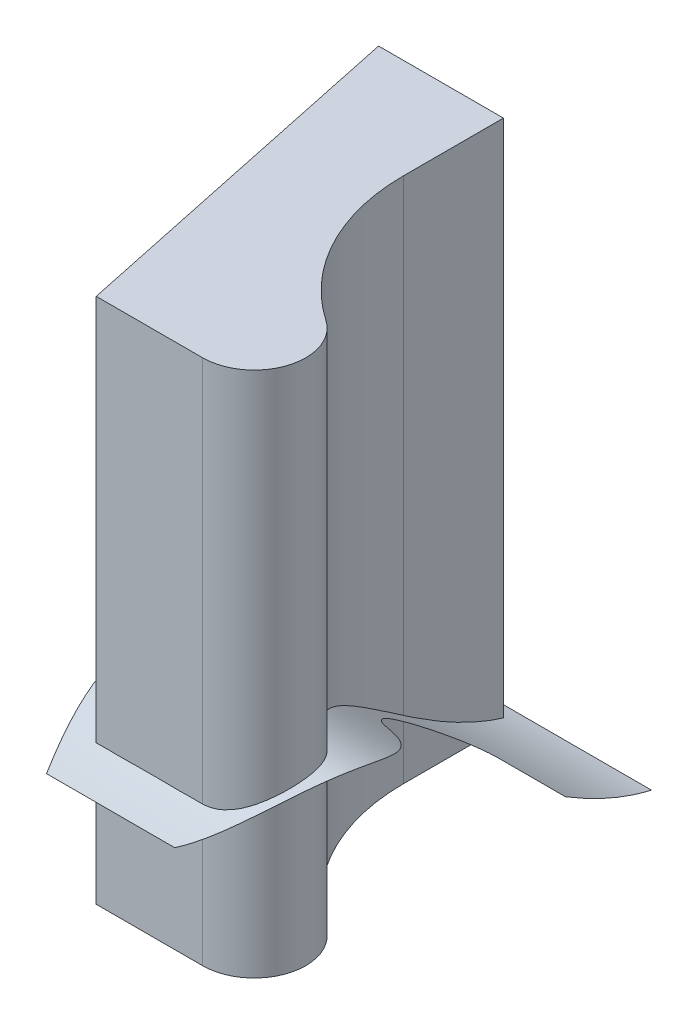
ISO-10303-21;
HEADER;
FILE_DESCRIPTION(('STEP AP214'),'2;1');
FILE_NAME('part.step','',(''),(''),'','','');
FILE_SCHEMA(('AUTOMOTIVE_DESIGN { 1 0 10303 214 1 1 1 1 }'));
ENDSEC;
DATA;
#1=APPLICATION_CONTEXT('core data for automotive mechanical design processes');
#2=APPLICATION_PROTOCOL_DEFINITION('international standard','automotive_design',2000,#1);
#3=PRODUCT_CONTEXT('',#1,'mechanical');
#4=PRODUCT('Part','Part','',(#3));
#5=PRODUCT_RELATED_PRODUCT_CATEGORY('part','',(#4));
#6=PRODUCT_DEFINITION_FORMATION('','',#4);
#7=PRODUCT_DEFINITION_CONTEXT('part definition',#1,'design');
#8=PRODUCT_DEFINITION('design','',#6,#7);
#9=PRODUCT_DEFINITION_SHAPE('','',#8);
#10=(LENGTH_UNIT() NAMED_UNIT(*) SI_UNIT(.MILLI.,.METRE.));
#11=(NAMED_UNIT(*) PLANE_ANGLE_UNIT() SI_UNIT($,.RADIAN.));
#12=(NAMED_UNIT(*) SI_UNIT($,.STERADIAN.) SOLID_ANGLE_UNIT());
#13=UNCERTAINTY_MEASURE_WITH_UNIT(LENGTH_MEASURE(1.E-05),#10,'distance_accuracy_value','');
#14=(GEOMETRIC_REPRESENTATION_CONTEXT(3) GLOBAL_UNCERTAINTY_ASSIGNED_CONTEXT((#13)) GLOBAL_UNIT_ASSIGNED_CONTEXT((#10,
#11,#12)) REPRESENTATION_CONTEXT('',''));
#15=CARTESIAN_POINT('',(0.,0.,0.));
#16=DIRECTION('',(0.,0.,1.));
#17=DIRECTION('',(1.,0.,0.));
#18=AXIS2_PLACEMENT_3D('',#15,#16,#17);
#19=CARTESIAN_POINT('',(6.68799385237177,101.6,-39.379349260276));
#20=DIRECTION('',(0.,0.,1.));
#21=DIRECTION('',(1.,0.,0.));
#22=AXIS2_PLACEMENT_3D('',#19,#20,#21);
#23=PLANE('',#22);
#24=DIRECTION('',(-1.,0.,0.));
#25=VECTOR('',#24,1.);
#26=CARTESIAN_POINT('',(6.68799385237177,0.,-39.379349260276));
#27=LINE('',#26,#25);
#28=CARTESIAN_POINT('',(6.68799385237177,0.,-39.379349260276));
#29=VERTEX_POINT('',#28);
#30=CARTESIAN_POINT('',(-17.4066623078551,0.,-39.379349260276));
#31=VERTEX_POINT('',#30);
#32=EDGE_CURVE('E136',#29,#31,#27,.T.);
#33=ORIENTED_EDGE('',*,*,#32,.T.);
#34=DIRECTION('',(0.,-1.,0.));
#35=VECTOR('',#34,1.);
#36=CARTESIAN_POINT('',(-17.4066623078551,101.6,-39.379349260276));
#37=LINE('',#36,#35);
#38=CARTESIAN_POINT('',(-17.4066623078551,101.6,-39.379349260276));
#39=VERTEX_POINT('',#38);
#40=EDGE_CURVE('E12',#39,#31,#37,.T.);
#41=ORIENTED_EDGE('',*,*,#40,.F.);
#42=DIRECTION('',(-1.,0.,0.));
#43=VECTOR('',#42,1.);
#44=CARTESIAN_POINT('',(6.68799385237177,101.6,-39.379349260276));
#45=LINE('',#44,#43);
#46=CARTESIAN_POINT('',(6.68799385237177,101.6,-39.379349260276));
#47=VERTEX_POINT('',#46);
#48=EDGE_CURVE('E146',#47,#39,#45,.T.);
#49=ORIENTED_EDGE('',*,*,#48,.F.);
#50=DIRECTION('',(0.,-1.,0.));
#51=VECTOR('',#50,1.);
#52=CARTESIAN_POINT('',(6.68799385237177,101.6,-39.379349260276));
#53=LINE('',#52,#51);
#54=EDGE_CURVE('E132',#47,#29,#53,.T.);
#55=ORIENTED_EDGE('',*,*,#54,.T.);
#56=EDGE_LOOP('',(#33,#41,#49,#55));
#57=FACE_BOUND('',#56,.T.);
#58=ADVANCED_FACE('F52',(#57),#23,.F.);
#59=CARTESIAN_POINT('',(-17.4066623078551,101.6,-39.379349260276));
#60=DIRECTION('',(0.97840332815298,0.,-0.206704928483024));
#61=DIRECTION('',(-0.206704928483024,0.,-0.97840332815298));
#62=AXIS2_PLACEMENT_3D('',#59,#60,#61);
#63=PLANE('',#62);
#64=DIRECTION('',(0.206704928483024,0.,0.97840332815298));
#65=VECTOR('',#64,1.);
#66=CARTESIAN_POINT('',(-17.4066623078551,0.,-39.379349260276));
#67=LINE('',#66,#65);
#68=CARTESIAN_POINT('',(-2.81317454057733,0.,29.6964928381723));
#69=VERTEX_POINT('',#68);
#70=EDGE_CURVE('E139',#31,#69,#67,.T.);
#71=ORIENTED_EDGE('',*,*,#70,.T.);
#72=DIRECTION('',(0.,-1.,0.));
#73=VECTOR('',#72,1.);
#74=CARTESIAN_POINT('',(-2.81317454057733,101.6,29.6964928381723));
#75=LINE('',#74,#73);
#76=CARTESIAN_POINT('',(-2.81317454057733,101.6,29.6964928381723));
#77=VERTEX_POINT('',#76);
#78=EDGE_CURVE('E60',#77,#69,#75,.T.);
#79=ORIENTED_EDGE('',*,*,#78,.F.);
#80=DIRECTION('',(0.206704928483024,0.,0.97840332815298));
#81=VECTOR('',#80,1.);
#82=CARTESIAN_POINT('',(-17.4066623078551,101.6,-39.379349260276));
#83=LINE('',#82,#81);
#84=EDGE_CURVE('E105',#39,#77,#83,.T.);
#85=ORIENTED_EDGE('',*,*,#84,.F.);
#86=ORIENTED_EDGE('',*,*,#40,.T.);
#87=EDGE_LOOP('',(#71,#79,#85,#86));
#88=FACE_BOUND('',#87,.T.);
#89=ADVANCED_FACE('F170',(#88),#63,.F.);
#90=CARTESIAN_POINT('',(-2.81317454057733,101.6,29.6964928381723));
#91=DIRECTION('',(0.,0.,-1.));
#92=DIRECTION('',(-1.,0.,0.));
#93=AXIS2_PLACEMENT_3D('',#90,#91,#92);
#94=PLANE('',#93);
#95=DIRECTION('',(1.,0.,0.));
#96=VECTOR('',#95,1.);
#97=CARTESIAN_POINT('',(-2.81317454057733,0.,29.6964928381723));
#98=LINE('',#97,#96);
#99=CARTESIAN_POINT('',(17.7258082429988,0.,29.6964928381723));
#100=VERTEX_POINT('',#99);
#101=EDGE_CURVE('E141',#69,#100,#98,.T.);
#102=ORIENTED_EDGE('',*,*,#101,.T.);
#103=DIRECTION('',(0.,-1.,0.));
#104=VECTOR('',#103,1.);
#105=CARTESIAN_POINT('',(17.7258082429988,101.6,29.6964928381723));
#106=LINE('',#105,#104);
#107=CARTESIAN_POINT('',(17.7258082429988,101.6,29.6964928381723));
#108=VERTEX_POINT('',#107);
#109=EDGE_CURVE('E127',#108,#100,#106,.T.);
#110=ORIENTED_EDGE('',*,*,#109,.F.);
#111=DIRECTION('',(1.,0.,0.));
#112=VECTOR('',#111,1.);
#113=CARTESIAN_POINT('',(-2.81317454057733,101.6,29.6964928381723));
#114=LINE('',#113,#112);
#115=EDGE_CURVE('E118',#77,#108,#114,.T.);
#116=ORIENTED_EDGE('',*,*,#115,.F.);
#117=ORIENTED_EDGE('',*,*,#78,.T.);
#118=EDGE_LOOP('',(#102,#110,#116,#117));
#119=FACE_BOUND('',#118,.T.);
#120=ADVANCED_FACE('F152',(#119),#94,.F.);
#121=CARTESIAN_POINT('',(17.7258082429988,101.6,19.7461535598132));
#122=DIRECTION('',(0.,-1.,0.));
#123=DIRECTION('',(0.,0.,-1.));
#124=AXIS2_PLACEMENT_3D('',#121,#122,#123);
#125=CYLINDRICAL_SURFACE('',#124,9.95033927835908);
#126=CARTESIAN_POINT('',(17.7258082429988,0.,19.7461535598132));
#127=DIRECTION('',(0.,1.,0.));
#128=DIRECTION('',(0.,0.,1.));
#129=AXIS2_PLACEMENT_3D('',#126,#127,#128);
#130=CIRCLE('',#129,9.95033927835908);
#131=CARTESIAN_POINT('',(23.3470035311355,0.,11.5357080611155));
#132=VERTEX_POINT('',#131);
#133=EDGE_CURVE('E126',#100,#132,#130,.T.);
#134=ORIENTED_EDGE('',*,*,#133,.T.);
#135=DIRECTION('',(0.,-1.,0.));
#136=VECTOR('',#135,1.);
#137=CARTESIAN_POINT('',(23.3470035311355,101.6,11.5357080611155));
#138=LINE('',#137,#136);
#139=CARTESIAN_POINT('',(23.3470035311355,101.6,11.5357080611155));
#140=VERTEX_POINT('',#139);
#141=EDGE_CURVE('E123',#140,#132,#138,.T.);
#142=ORIENTED_EDGE('',*,*,#141,.F.);
#143=CARTESIAN_POINT('',(17.7258082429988,101.6,19.7461535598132));
#144=DIRECTION('',(0.,1.,0.));
#145=DIRECTION('',(0.,0.,1.));
#146=AXIS2_PLACEMENT_3D('',#143,#144,#145);
#147=CIRCLE('',#146,9.95033927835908);
#148=EDGE_CURVE('E112',#108,#140,#147,.T.);
#149=ORIENTED_EDGE('',*,*,#148,.F.);
#150=ORIENTED_EDGE('',*,*,#109,.T.);
#151=EDGE_LOOP('',(#134,#142,#149,#150));
#152=FACE_BOUND('',#151,.T.);
#153=ADVANCED_FACE('F124',(#152),#125,.T.);
#154=CARTESIAN_POINT('',(44.9779649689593,101.6,-20.0589654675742));
#155=DIRECTION('',(0.,-1.,0.));
#156=DIRECTION('',(0.,0.,-1.));
#157=AXIS2_PLACEMENT_3D('',#154,#155,#156);
#158=CYLINDRICAL_SURFACE('',#157,38.2899711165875);
#159=CARTESIAN_POINT('',(44.9779649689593,0.,-20.0589654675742));
#160=DIRECTION('',(0.,-1.,0.));
#161=DIRECTION('',(0.,0.,-1.));
#162=AXIS2_PLACEMENT_3D('',#159,#160,#161);
#163=CIRCLE('',#162,38.2899711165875);
#164=CARTESIAN_POINT('',(6.68799385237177,0.,-20.0589654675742));
#165=VERTEX_POINT('',#164);
#166=EDGE_CURVE('E91',#132,#165,#163,.T.);
#167=ORIENTED_EDGE('',*,*,#166,.T.);
#168=DIRECTION('',(0.,-1.,0.));
#169=VECTOR('',#168,1.);
#170=CARTESIAN_POINT('',(6.68799385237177,101.6,-20.0589654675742));
#171=LINE('',#170,#169);
#172=CARTESIAN_POINT('',(6.68799385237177,101.6,-20.0589654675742));
#173=VERTEX_POINT('',#172);
#174=EDGE_CURVE('E128',#173,#165,#171,.T.);
#175=ORIENTED_EDGE('',*,*,#174,.F.);
#176=CARTESIAN_POINT('',(44.9779649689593,101.6,-20.0589654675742));
#177=DIRECTION('',(0.,-1.,0.));
#178=DIRECTION('',(0.,0.,-1.));
#179=AXIS2_PLACEMENT_3D('',#176,#177,#178);
#180=CIRCLE('',#179,38.2899711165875);
#181=EDGE_CURVE('E116',#140,#173,#180,.T.);
#182=ORIENTED_EDGE('',*,*,#181,.F.);
#183=ORIENTED_EDGE('',*,*,#141,.T.);
#184=EDGE_LOOP('',(#167,#175,#182,#183));
#185=FACE_BOUND('',#184,.T.);
#186=ADVANCED_FACE('F130',(#185),#158,.F.);
#187=CARTESIAN_POINT('',(6.68799385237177,101.6,-20.0589654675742));
#188=DIRECTION('',(-1.,0.,0.));
#189=DIRECTION('',(0.,0.,1.));
#190=AXIS2_PLACEMENT_3D('',#187,#188,#189);
#191=PLANE('',#190);
#192=DIRECTION('',(0.,0.,-1.));
#193=VECTOR('',#192,1.);
#194=CARTESIAN_POINT('',(6.68799385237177,0.,-20.0589654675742));
#195=LINE('',#194,#193);
#196=EDGE_CURVE('E97',#165,#29,#195,.T.);
#197=ORIENTED_EDGE('',*,*,#196,.T.);
#198=ORIENTED_EDGE('',*,*,#54,.F.);
#199=DIRECTION('',(0.,0.,-1.));
#200=VECTOR('',#199,1.);
#201=CARTESIAN_POINT('',(6.68799385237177,101.6,-20.0589654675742));
#202=LINE('',#201,#200);
#203=EDGE_CURVE('E68',#173,#47,#202,.T.);
#204=ORIENTED_EDGE('',*,*,#203,.F.);
#205=ORIENTED_EDGE('',*,*,#174,.T.);
#206=EDGE_LOOP('',(#197,#198,#204,#205));
#207=FACE_BOUND('',#206,.T.);
#208=ADVANCED_FACE('F159',(#207),#191,.F.);
#209=CARTESIAN_POINT('',(17.7258082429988,101.6,19.7461535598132));
#210=DIRECTION('',(0.,1.,0.));
#211=DIRECTION('',(0.,0.,1.));
#212=AXIS2_PLACEMENT_3D('',#209,#210,#211);
#213=PLANE('',#212);
#214=ORIENTED_EDGE('',*,*,#48,.T.);
#215=ORIENTED_EDGE('',*,*,#84,.T.);
#216=ORIENTED_EDGE('',*,*,#115,.T.);
#217=ORIENTED_EDGE('',*,*,#148,.T.);
#218=ORIENTED_EDGE('',*,*,#181,.T.);
#219=ORIENTED_EDGE('',*,*,#203,.T.);
#220=EDGE_LOOP('',(#214,#215,#216,#217,#218,#219));
#221=FACE_BOUND('',#220,.T.);
#222=ADVANCED_FACE('F114',(#221),#213,.T.);
#223=CARTESIAN_POINT('',(17.7258082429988,0.,19.7461535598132));
#224=DIRECTION('',(0.,1.,0.));
#225=DIRECTION('',(0.,0.,1.));
#226=AXIS2_PLACEMENT_3D('',#223,#224,#225);
#227=PLANE('',#226);
#228=ORIENTED_EDGE('',*,*,#32,.F.);
#229=ORIENTED_EDGE('',*,*,#196,.F.);
#230=ORIENTED_EDGE('',*,*,#166,.F.);
#231=ORIENTED_EDGE('',*,*,#133,.F.);
#232=ORIENTED_EDGE('',*,*,#101,.F.);
#233=ORIENTED_EDGE('',*,*,#70,.F.);
#234=EDGE_LOOP('',(#228,#229,#230,#231,#232,#233));
#235=FACE_BOUND('',#234,.T.);
#236=ADVANCED_FACE('F155',(#235),#227,.F.);
#237=CLOSED_SHELL('',(#58,#89,#120,#153,#186,#208,#222,#236));
#238=MANIFOLD_SOLID_BREP('B2',#237);
#239=CARTESIAN_POINT('',(-50.8,-4.61815557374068,50.2563988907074));
#240=CARTESIAN_POINT('',(-50.8,81.4124609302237,13.8907957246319));
#241=CARTESIAN_POINT('',(-50.8,-15.5554107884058,-14.6119008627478));
#242=CARTESIAN_POINT('',(-50.8,1.62993726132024,-62.2092721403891));
#243=B_SPLINE_CURVE_WITH_KNOTS('',3,(#239,#240,#241,#242),.UNSPECIFIED.,.F.,.F.,(4,4),(0.,1.),.UNSPECIFIED.);
#244=DIRECTION('',(1.,0.,0.));
#245=VECTOR('',#244,1.);
#246=SURFACE_OF_LINEAR_EXTRUSION('',#243,#245);
#247=CARTESIAN_POINT('',(-7.26417737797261,22.1795320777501,34.8413219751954));
#248=CARTESIAN_POINT('',(-7.33516467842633,22.5826225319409,34.4847880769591));
#249=CARTESIAN_POINT('',(-7.40753983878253,22.9794122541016,34.1212563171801));
#250=CARTESIAN_POINT('',(-7.5551825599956,23.7576071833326,33.3796457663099));
#251=CARTESIAN_POINT('',(-7.63044637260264,24.1390310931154,33.0015858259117));
#252=CARTESIAN_POINT('',(-7.78387756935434,24.8833636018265,32.2308975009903));
#253=CARTESIAN_POINT('',(-7.86203324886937,25.2463351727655,31.8383278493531));
#254=CARTESIAN_POINT('',(-8.02125847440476,25.9505731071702,31.038586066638));
#255=CARTESIAN_POINT('',(-8.1023096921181,26.2919475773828,30.6315058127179));
#256=CARTESIAN_POINT('',(-8.2673315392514,26.9498769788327,29.8027175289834));
#257=CARTESIAN_POINT('',(-8.35127957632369,27.266579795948,29.38112274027));
#258=CARTESIAN_POINT('',(-8.52211104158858,27.8721667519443,28.5232103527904));
#259=CARTESIAN_POINT('',(-8.60897087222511,28.1612239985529,28.0870111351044));
#260=CARTESIAN_POINT('',(-8.74162850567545,28.5722886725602,27.4208069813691));
#261=CARTESIAN_POINT('',(-8.78613886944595,28.7052806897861,27.1972744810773));
#262=CARTESIAN_POINT('',(-8.87588696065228,28.9632509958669,26.7465471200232));
#263=CARTESIAN_POINT('',(-8.9211225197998,29.0882490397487,26.5193631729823));
#264=CARTESIAN_POINT('',(-9.00638560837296,29.3141690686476,26.091128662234));
#265=CARTESIAN_POINT('',(-9.04631263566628,29.4160914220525,25.8905858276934));
#266=CARTESIAN_POINT('',(-9.10756793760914,29.5664099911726,25.5829112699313));
#267=CARTESIAN_POINT('',(-9.12867923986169,29.6171388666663,25.4768719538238));
#268=CARTESIAN_POINT('',(-9.17166296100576,29.7182126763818,25.2609704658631));
#269=CARTESIAN_POINT('',(-9.19353999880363,29.7685060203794,25.1510850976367));
#270=CARTESIAN_POINT('',(-9.27298236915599,29.9469262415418,24.7520597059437));
#271=CARTESIAN_POINT('',(-9.33104034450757,30.0693753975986,24.4604496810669));
#272=CARTESIAN_POINT('',(-9.45187983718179,30.3073984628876,23.8535243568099));
#273=CARTESIAN_POINT('',(-9.51472978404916,30.4220643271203,23.5378665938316));
#274=CARTESIAN_POINT('',(-9.64516304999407,30.640830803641,22.8827991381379));
#275=CARTESIAN_POINT('',(-9.7128102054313,30.743939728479,22.5430700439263));
#276=CARTESIAN_POINT('',(-9.85284358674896,30.9358154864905,21.8397925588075));
#277=CARTESIAN_POINT('',(-9.92528684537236,31.0234913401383,21.4759566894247));
#278=CARTESIAN_POINT('',(-10.0594279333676,31.1644117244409,20.80226948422));
#279=CARTESIAN_POINT('',(-10.1209953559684,31.2209182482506,20.4930703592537));
#280=CARTESIAN_POINT('',(-10.2387376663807,31.3134895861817,19.9017950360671));
#281=CARTESIAN_POINT('',(-10.294868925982,31.3509868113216,19.619934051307));
#282=CARTESIAN_POINT('',(-10.4017180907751,31.409912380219,19.0833873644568));
#283=CARTESIAN_POINT('',(-10.4524101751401,31.432581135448,18.8288320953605));
#284=CARTESIAN_POINT('',(-10.5483697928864,31.4656538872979,18.346940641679));
#285=CARTESIAN_POINT('',(-10.5936238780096,31.4771285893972,18.1196742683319));
#286=CARTESIAN_POINT('',(-10.69076056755,31.4930712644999,17.6318201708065));
#287=CARTESIAN_POINT('',(-10.7426503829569,31.496278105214,17.3711914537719));
#288=CARTESIAN_POINT('',(-10.8367580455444,31.4927027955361,16.8984693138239));
#289=CARTESIAN_POINT('',(-10.8789806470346,31.4876667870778,16.6863602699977));
#290=CARTESIAN_POINT('',(-10.9766892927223,31.4682542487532,16.1954765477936));
#291=CARTESIAN_POINT('',(-11.0321552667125,31.4514312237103,15.9167914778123));
#292=CARTESIAN_POINT('',(-11.1457715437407,31.4055015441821,15.3460900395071));
#293=CARTESIAN_POINT('',(-11.2039142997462,31.3758115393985,15.0541195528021));
#294=CARTESIAN_POINT('',(-11.3189119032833,31.3053329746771,14.4766438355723));
#295=CARTESIAN_POINT('',(-11.3757715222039,31.2647470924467,14.191114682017));
#296=CARTESIAN_POINT('',(-11.4882101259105,31.1736346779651,13.6265078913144));
#297=CARTESIAN_POINT('',(-11.5437945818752,31.1232865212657,13.3474024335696));
#298=CARTESIAN_POINT('',(-11.6536805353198,31.013736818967,12.7956302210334));
#299=CARTESIAN_POINT('',(-11.707988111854,30.9546942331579,12.5229329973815));
#300=CARTESIAN_POINT('',(-11.8153211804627,30.8287752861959,11.9839654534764));
#301=CARTESIAN_POINT('',(-11.8683531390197,30.7620423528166,11.717662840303));
#302=CARTESIAN_POINT('',(-11.9731334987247,30.621701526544,11.1914847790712));
#303=CARTESIAN_POINT('',(-12.0248886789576,30.548224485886,10.9315755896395));
#304=CARTESIAN_POINT('',(-12.1769245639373,30.320778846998,10.1680332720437));
#305=CARTESIAN_POINT('',(-12.2766228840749,30.1566237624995,9.66729277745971));
#306=CARTESIAN_POINT('',(-12.4708458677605,29.8105291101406,8.69171015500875));
#307=CARTESIAN_POINT('',(-12.5654286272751,29.6294265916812,8.21657930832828));
#308=CARTESIAN_POINT('',(-12.7494333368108,29.2551679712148,7.29219516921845));
#309=CARTESIAN_POINT('',(-12.8389131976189,29.0627514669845,6.84265280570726));
#310=CARTESIAN_POINT('',(-13.0127196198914,28.6708728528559,5.96951716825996));
#311=CARTESIAN_POINT('',(-13.0971024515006,28.4720683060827,5.54563865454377));
#312=CARTESIAN_POINT('',(-13.2767472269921,28.0324909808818,4.64333705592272));
#313=CARTESIAN_POINT('',(-13.3718317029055,27.7897907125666,4.16582040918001));
#314=CARTESIAN_POINT('',(-13.6538572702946,27.0436993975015,2.74947676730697));
#315=CARTESIAN_POINT('',(-13.8387189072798,26.5196965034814,1.8210887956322));
#316=CARTESIAN_POINT('',(-14.2014656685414,25.4390846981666,-0.000752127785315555));
#317=CARTESIAN_POINT('',(-14.3794103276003,24.8829899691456,-0.894502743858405));
#318=CARTESIAN_POINT('',(-14.7283385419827,23.754647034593,-2.64712587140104));
#319=CARTESIAN_POINT('',(-14.8993901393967,23.1829448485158,-3.50633843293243));
#320=CARTESIAN_POINT('',(-15.2494117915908,21.9864054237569,-5.26427364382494));
#321=CARTESIAN_POINT('',(-15.4282373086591,21.3604429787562,-6.16225426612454));
#322=CARTESIAN_POINT('',(-15.7834774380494,20.0989501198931,-7.94600619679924));
#323=CARTESIAN_POINT('',(-15.9598990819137,19.463471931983,-8.83181325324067));
#324=CARTESIAN_POINT('',(-16.3103265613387,18.1931025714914,-10.5913938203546));
#325=CARTESIAN_POINT('',(-16.4843395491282,17.55826162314,-11.465202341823));
#326=CARTESIAN_POINT('',(-16.8299577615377,16.2981505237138,-13.2009033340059));
#327=CARTESIAN_POINT('',(-17.0015622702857,15.6728718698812,-14.0627897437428));
#328=CARTESIAN_POINT('',(-17.3423762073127,14.439745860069,-15.7747030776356));
#329=CARTESIAN_POINT('',(-17.5115712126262,13.831790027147,-16.6246544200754));
#330=CARTESIAN_POINT('',(-17.847581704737,12.6401012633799,-18.312692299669));
#331=CARTESIAN_POINT('',(-18.0143653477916,12.0561309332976,-19.1506168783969));
#332=CARTESIAN_POINT('',(-18.3455765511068,10.9182017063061,-20.8145212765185));
#333=CARTESIAN_POINT('',(-18.5099529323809,10.3638572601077,-21.6402467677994));
#334=CARTESIAN_POINT('',(-18.8642193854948,9.1983068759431,-23.4195894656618));
#335=CARTESIAN_POINT('',(-19.0544742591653,8.58993505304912,-24.37500114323));
#336=CARTESIAN_POINT('',(-19.4348245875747,7.41794189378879,-26.2849896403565));
#337=CARTESIAN_POINT('',(-19.6248409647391,6.85365274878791,-27.2391700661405));
#338=CARTESIAN_POINT('',(-20.0047390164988,5.77683062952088,-29.1469102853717));
#339=CARTESIAN_POINT('',(-20.1945244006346,5.26340917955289,-30.0999852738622));
#340=CARTESIAN_POINT('',(-20.5739924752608,4.29451090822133,-32.0057422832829));
#341=CARTESIAN_POINT('',(-20.7635678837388,3.83793755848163,-32.9578825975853));
#342=CARTESIAN_POINT('',(-21.0495550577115,3.19683510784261,-34.3943373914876));
#343=CARTESIAN_POINT('',(-21.1442610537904,2.99214558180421,-34.8700401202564));
#344=CARTESIAN_POINT('',(-21.3336274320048,2.59907887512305,-35.8212386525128));
#345=CARTESIAN_POINT('',(-21.4282746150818,2.41053486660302,-36.2966678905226));
#346=CARTESIAN_POINT('',(-21.6175206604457,2.05031643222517,-37.2472966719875));
#347=CARTESIAN_POINT('',(-21.7121070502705,1.87846997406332,-37.7224334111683));
#348=CARTESIAN_POINT('',(-21.9012309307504,1.55215265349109,-38.6724614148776));
#349=CARTESIAN_POINT('',(-21.995756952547,1.3975077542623,-39.1472950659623));
#350=CARTESIAN_POINT('',(-22.1847598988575,1.10605833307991,-40.09670007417));
#351=CARTESIAN_POINT('',(-22.2792266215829,0.969081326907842,-40.5712203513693));
#352=CARTESIAN_POINT('',(-22.4681053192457,0.713379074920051,-41.5199500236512));
#353=CARTESIAN_POINT('',(-22.5625086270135,0.594486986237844,-41.9941162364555));
#354=CARTESIAN_POINT('',(-22.6573151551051,0.4844285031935,-42.4702801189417));
#355=B_SPLINE_CURVE_WITH_KNOTS('',3,(#247,#248,#249,#250,#251,#252,#253,#254,#255,#256,#257,
#258,#259,#260,#261,#262,#263,#264,#265,#266,#267,#268,#269,#270,#271,#272,#273,#274,#275,#276,
#277,#278,#279,#280,#281,#282,#283,#284,#285,#286,#287,#288,#289,#290,#291,#292,#293,#294,#295,
#296,#297,#298,#299,#300,#301,#302,#303,#304,#305,#306,#307,#308,#309,#310,#311,#312,#313,#314,
#315,#316,#317,#318,#319,#320,#321,#322,#323,#324,#325,#326,#327,#328,#329,#330,#331,#332,#333,
#334,#335,#336,#337,#338,#339,#340,#341,#342,#343,#344,#345,#346,#347,#348,#349,#350,#351,#352,
#353,#354),.UNSPECIFIED.,.F.,.F.,(4,2,2,2,2,2,2,2,2,2,2,2,2,2,2,2,2,2,2,2,2,2,2,2,2,2,2,2,2,2,2,
2,2,2,2,2,2,2,2,2,2,2,2,2,2,2,2,2,2,2,2,2,2,4),(0.,1.62847979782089,3.25491357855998,
4.87536197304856,6.48692460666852,8.08793437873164,9.67815355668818,10.4696847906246,
11.2591776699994,11.9444835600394,12.3027572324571,12.6711806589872,13.6354884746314,
14.6600666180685,15.743776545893,16.8866789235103,17.8471656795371,18.7163646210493,
19.497778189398,20.1936785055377,20.9907469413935,21.6396391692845,22.4933460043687,
23.3906437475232,24.2722860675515,25.1391232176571,25.9917258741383,26.8304267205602,
27.6553585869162,29.2635213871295,30.8146586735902,32.305654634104,33.7326121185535,
35.3644436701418,38.6088246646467,41.8109061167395,44.9489032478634,48.2761368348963,
51.5891725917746,54.8711852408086,58.1068300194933,61.2826151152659,64.387110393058,
67.4110406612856,70.8561470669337,74.2295590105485,77.5258267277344,80.7428267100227,
82.3220296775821,83.8822052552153,85.4240681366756,86.9485495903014,88.4567927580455,
89.9501455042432),.UNSPECIFIED.);
#356=CARTESIAN_POINT('',(-7.26417737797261,22.1795320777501,34.8413219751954));
#357=VERTEX_POINT('',#356);
#358=CARTESIAN_POINT('',(-22.6573151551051,0.4844285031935,-42.4702801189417));
#359=VERTEX_POINT('',#358);
#360=EDGE_CURVE('E261',#357,#359,#355,.T.);
#361=ORIENTED_EDGE('',*,*,#360,.T.);
#362=DIRECTION('',(1.,0.,0.));
#363=VECTOR('',#362,1.);
#364=CARTESIAN_POINT('',(-50.8,0.484428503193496,-42.4702801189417));
#365=LINE('',#364,#363);
#366=CARTESIAN_POINT('',(32.1699283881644,0.484428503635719,-42.4702801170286));
#367=VERTEX_POINT('',#366);
#368=EDGE_CURVE('E50',#359,#367,#365,.T.);
#369=ORIENTED_EDGE('',*,*,#368,.T.);
#370=CARTESIAN_POINT('',(32.1699283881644,-4.61815557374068,50.2563988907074));
#371=CARTESIAN_POINT('',(32.1699283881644,81.4124609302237,13.8907957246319));
#372=CARTESIAN_POINT('',(32.1699283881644,-15.5554107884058,-14.6119008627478));
#373=CARTESIAN_POINT('',(32.1699283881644,1.62993726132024,-62.2092721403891));
#374=B_SPLINE_CURVE_WITH_KNOTS('',3,(#370,#371,#372,#373),.UNSPECIFIED.,.F.,.F.,(4,4),(0.,1.),.UNSPECIFIED.);
#375=CARTESIAN_POINT('',(32.1699283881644,7.67698529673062,-25.8664461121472));
#376=VERTEX_POINT('',#375);
#377=EDGE_CURVE('E237',#367,#376,#374,.F.);
#378=ORIENTED_EDGE('',*,*,#377,.T.);
#379=DIRECTION('',(1.,0.,0.));
#380=VECTOR('',#379,1.);
#381=CARTESIAN_POINT('',(-50.8,7.67698529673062,-25.8664461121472));
#382=LINE('',#381,#380);
#383=CARTESIAN_POINT('',(19.5440962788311,7.67698529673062,-25.8664461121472));
#384=VERTEX_POINT('',#383);
#385=EDGE_CURVE('E282',#376,#384,#382,.F.);
#386=ORIENTED_EDGE('',*,*,#385,.T.);
#387=CARTESIAN_POINT('',(19.5440962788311,7.67698529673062,-25.8664461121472));
#388=CARTESIAN_POINT('',(19.3900774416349,7.67697601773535,-25.8664638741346));
#389=CARTESIAN_POINT('',(19.2360570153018,7.67923081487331,-25.8627354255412));
#390=CARTESIAN_POINT('',(18.9287776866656,7.68826130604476,-25.8478155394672));
#391=CARTESIAN_POINT('',(18.7755179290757,7.69502919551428,-25.8366369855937));
#392=CARTESIAN_POINT('',(18.4697598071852,7.71309218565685,-25.8068238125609));
#393=CARTESIAN_POINT('',(18.3172629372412,7.72439408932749,-25.7881779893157));
#394=CARTESIAN_POINT('',(18.0129989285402,7.75152615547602,-25.7434627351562));
#395=CARTESIAN_POINT('',(17.86123905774,7.76737829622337,-25.717357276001));
#396=CARTESIAN_POINT('',(17.5604982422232,7.80337806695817,-25.658151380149));
#397=CARTESIAN_POINT('',(17.4115065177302,7.82350124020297,-25.6250907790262));
#398=CARTESIAN_POINT('',(17.1156857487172,7.86809676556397,-25.5519406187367));
#399=CARTESIAN_POINT('',(16.9688601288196,7.89257534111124,-25.5118410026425));
#400=CARTESIAN_POINT('',(16.6773944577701,7.9458977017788,-25.4246518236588));
#401=CARTESIAN_POINT('',(16.5327666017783,7.97475990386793,-25.3775327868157));
#402=CARTESIAN_POINT('',(16.2456309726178,8.03688521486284,-25.2763214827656));
#403=CARTESIAN_POINT('',(16.1031481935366,8.07018058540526,-25.2221781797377));
#404=CARTESIAN_POINT('',(15.8246434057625,8.14011720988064,-25.10871389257));
#405=CARTESIAN_POINT('',(15.6885489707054,8.1766769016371,-25.0495202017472));
#406=CARTESIAN_POINT('',(15.4196105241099,8.25376889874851,-24.9250066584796));
#407=CARTESIAN_POINT('',(15.2867824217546,8.29431712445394,-24.8596623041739));
#408=CARTESIAN_POINT('',(15.0244201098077,8.37940530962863,-24.7229012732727));
#409=CARTESIAN_POINT('',(14.8949128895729,8.42396947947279,-24.6514479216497));
#410=CARTESIAN_POINT('',(14.6391050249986,8.51715092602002,-24.502459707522));
#411=CARTESIAN_POINT('',(14.5128476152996,8.56580329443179,-24.4248726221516));
#412=CARTESIAN_POINT('',(14.2675611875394,8.66556946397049,-24.2662412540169));
#413=CARTESIAN_POINT('',(14.1484374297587,8.71661317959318,-24.1852992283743));
#414=CARTESIAN_POINT('',(13.9142239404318,8.82224320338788,-24.0182963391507));
#415=CARTESIAN_POINT('',(13.799163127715,8.87684915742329,-23.9322073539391));
#416=CARTESIAN_POINT('',(13.5731357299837,8.98960869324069,-23.7549829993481));
#417=CARTESIAN_POINT('',(13.4622080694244,9.04778661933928,-23.6638135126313));
#418=CARTESIAN_POINT('',(13.2443496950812,9.16776927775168,-23.4763846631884));
#419=CARTESIAN_POINT('',(13.1374748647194,9.22960631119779,-23.3800810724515));
#420=CARTESIAN_POINT('',(12.931538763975,9.35463280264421,-23.1859961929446));
#421=CARTESIAN_POINT('',(12.8323521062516,9.41775510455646,-23.0883045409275));
#422=CARTESIAN_POINT('',(12.6385010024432,9.54703842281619,-22.8888520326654));
#423=CARTESIAN_POINT('',(12.5438730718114,9.61321761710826,-22.7870674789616));
#424=CARTESIAN_POINT('',(12.3592100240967,9.74859237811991,-22.5795234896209));
#425=CARTESIAN_POINT('',(12.269218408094,9.81780806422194,-22.4737385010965));
#426=CARTESIAN_POINT('',(12.0937321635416,9.95934664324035,-22.258112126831));
#427=CARTESIAN_POINT('',(12.0082970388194,10.031695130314,-22.1482391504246));
#428=CARTESIAN_POINT('',(11.8453847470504,10.1764595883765,-21.9290949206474));
#429=CARTESIAN_POINT('',(11.7677479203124,10.2488117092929,-21.8199000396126));
#430=CARTESIAN_POINT('',(11.6172185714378,10.3959813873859,-21.5984700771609));
#431=CARTESIAN_POINT('',(11.5443626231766,10.470812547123,-21.4862191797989));
#432=CARTESIAN_POINT('',(11.4034675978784,10.6228839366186,-21.2587948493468));
#433=CARTESIAN_POINT('',(11.3354686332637,10.7001380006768,-21.143605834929));
#434=CARTESIAN_POINT('',(11.2042032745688,10.8571545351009,-20.9101863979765));
#435=CARTESIAN_POINT('',(11.1409914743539,10.9369344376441,-20.7919370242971));
#436=CARTESIAN_POINT('',(11.0211104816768,11.0966203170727,-20.555945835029));
#437=CARTESIAN_POINT('',(10.9643426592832,11.1764972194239,-20.4382343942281));
#438=CARTESIAN_POINT('',(10.8557241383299,11.3381606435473,-20.2006628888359));
#439=CARTESIAN_POINT('',(10.8039053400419,11.4199558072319,-20.0807941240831));
#440=CARTESIAN_POINT('',(10.7052515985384,11.5853638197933,-19.8390510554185));
#441=CARTESIAN_POINT('',(10.6584494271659,11.66898477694,-19.7171689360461));
#442=CARTESIAN_POINT('',(10.5697624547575,11.8381536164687,-19.4712442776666));
#443=CARTESIAN_POINT('',(10.5279241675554,11.9237119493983,-19.347192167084));
#444=CARTESIAN_POINT('',(10.4505035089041,12.0938471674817,-19.1011374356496));
#445=CARTESIAN_POINT('',(10.4147955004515,12.1783986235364,-18.9791567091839));
#446=CARTESIAN_POINT('',(10.3482967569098,12.3488012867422,-18.733901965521));
#447=CARTESIAN_POINT('',(10.3175290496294,12.434656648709,-18.6106245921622));
#448=CARTESIAN_POINT('',(10.2609628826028,12.6075426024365,-18.3629434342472));
#449=CARTESIAN_POINT('',(10.2351862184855,12.6945766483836,-18.2385370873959));
#450=CARTESIAN_POINT('',(10.1885610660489,12.8699397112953,-17.9884116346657));
#451=CARTESIAN_POINT('',(10.16774754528,12.9582735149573,-17.8626893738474));
#452=CARTESIAN_POINT('',(10.1313441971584,13.1348764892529,-17.6118481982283));
#453=CARTESIAN_POINT('',(10.1157170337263,13.2231413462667,-17.4867316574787));
#454=CARTESIAN_POINT('',(10.0894508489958,13.4003690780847,-17.2359841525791));
#455=CARTESIAN_POINT('',(10.0788247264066,13.4893331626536,-17.1103526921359));
#456=CARTESIAN_POINT('',(10.0625909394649,13.6678049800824,-16.8587666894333));
#457=CARTESIAN_POINT('',(10.0569935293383,13.7573134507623,-16.7328120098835));
#458=CARTESIAN_POINT('',(10.0508068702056,13.9370072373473,-16.4803633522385));
#459=CARTESIAN_POINT('',(10.05024146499,14.0271937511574,-16.3538696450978));
#460=CARTESIAN_POINT('',(10.054104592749,14.2065975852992,-16.1026203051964));
#461=CARTESIAN_POINT('',(10.0584716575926,14.2958131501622,-15.9778624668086));
#462=CARTESIAN_POINT('',(10.0721264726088,14.4743023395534,-15.7286031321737));
#463=CARTESIAN_POINT('',(10.0814156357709,14.5635759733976,-15.6041017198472));
#464=CARTESIAN_POINT('',(10.1049150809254,14.7420048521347,-15.3555670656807));
#465=CARTESIAN_POINT('',(10.119123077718,14.8311601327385,-15.2315336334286));
#466=CARTESIAN_POINT('',(10.1524873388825,15.0094992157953,-14.9836956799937));
#467=CARTESIAN_POINT('',(10.1716554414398,15.098682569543,-14.8598924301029));
#468=CARTESIAN_POINT('',(10.2149610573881,15.2770491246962,-14.6125213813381));
#469=CARTESIAN_POINT('',(10.2391148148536,15.3662313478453,-14.4889557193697));
#470=CARTESIAN_POINT('',(10.2923376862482,15.5439884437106,-14.2428673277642));
#471=CARTESIAN_POINT('',(10.3213960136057,15.6325642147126,-14.1203429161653));
#472=CARTESIAN_POINT('',(10.3843912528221,15.8089149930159,-13.8765682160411));
#473=CARTESIAN_POINT('',(10.4183129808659,15.8966916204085,-13.7553151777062));
#474=CARTESIAN_POINT('',(10.4911060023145,16.0716061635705,-13.5138240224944));
#475=CARTESIAN_POINT('',(10.5299776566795,16.1587440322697,-13.3935859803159));
#476=CARTESIAN_POINT('',(10.6130853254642,16.3331768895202,-13.1529940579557));
#477=CARTESIAN_POINT('',(10.6573737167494,16.4204637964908,-13.0326523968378));
#478=CARTESIAN_POINT('',(10.7508232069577,16.5937196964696,-12.7938563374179));
#479=CARTESIAN_POINT('',(10.7999605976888,16.6796929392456,-12.6753957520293));
#480=CARTESIAN_POINT('',(10.9030253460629,16.850119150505,-12.4406086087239));
#481=CARTESIAN_POINT('',(10.9569242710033,16.9345779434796,-12.3242738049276));
#482=CARTESIAN_POINT('',(11.0696340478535,17.1021519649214,-12.0934653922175));
#483=CARTESIAN_POINT('',(11.128434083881,17.1852696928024,-11.9789883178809));
#484=CARTESIAN_POINT('',(11.2514410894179,17.3507718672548,-11.751028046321));
#485=CARTESIAN_POINT('',(11.3156817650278,17.4331476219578,-11.637556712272));
#486=CARTESIAN_POINT('',(11.4488284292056,17.5958732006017,-11.4133635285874));
#487=CARTESIAN_POINT('',(11.5176993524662,17.6762330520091,-11.3026281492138));
#488=CARTESIAN_POINT('',(11.6599695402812,17.8347274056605,-11.0841608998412));
#489=CARTESIAN_POINT('',(11.7333292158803,17.9128743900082,-10.9764123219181));
#490=CARTESIAN_POINT('',(11.884755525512,18.0671297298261,-10.7636442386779));
#491=CARTESIAN_POINT('',(11.96280236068,18.1432449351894,-10.6586156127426));
#492=CARTESIAN_POINT('',(12.1265217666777,18.2961248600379,-10.4475621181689));
#493=CARTESIAN_POINT('',(12.2123620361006,18.3728262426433,-10.3416213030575));
#494=CARTESIAN_POINT('',(12.3885754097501,18.5233705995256,-10.1335674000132));
#495=CARTESIAN_POINT('',(12.478901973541,18.5972327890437,-10.0314288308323));
#496=CARTESIAN_POINT('',(12.6638845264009,18.7419083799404,-9.83123719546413));
#497=CARTESIAN_POINT('',(12.7584906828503,18.8127442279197,-9.73315434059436));
#498=CARTESIAN_POINT('',(12.9522778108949,18.9515621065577,-9.54080312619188));
#499=CARTESIAN_POINT('',(13.0514325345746,19.0195570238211,-9.44651763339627));
#500=CARTESIAN_POINT('',(13.2569451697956,19.1543945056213,-9.25940135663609));
#501=CARTESIAN_POINT('',(13.3634143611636,19.2211776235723,-9.16664981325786));
#502=CARTESIAN_POINT('',(13.5804370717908,19.3511173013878,-8.98603374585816));
#503=CARTESIAN_POINT('',(13.6909412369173,19.4143026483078,-8.89813068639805));
#504=CARTESIAN_POINT('',(13.9157560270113,19.5368796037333,-8.7274566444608));
#505=CARTESIAN_POINT('',(14.0300162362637,19.5963033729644,-8.64464240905));
#506=CARTESIAN_POINT('',(14.2626585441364,19.7115463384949,-8.48389838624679));
#507=CARTESIAN_POINT('',(14.3810162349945,19.7673826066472,-8.40594552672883));
#508=CARTESIAN_POINT('',(14.6262638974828,19.8774194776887,-8.25219013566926));
#509=CARTESIAN_POINT('',(14.7533068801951,19.9315025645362,-8.17654720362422));
#510=CARTESIAN_POINT('',(15.0108409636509,20.0352368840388,-8.03133138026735));
#511=CARTESIAN_POINT('',(15.1412894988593,20.084924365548,-7.96170897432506));
#512=CARTESIAN_POINT('',(15.4052767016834,20.1797294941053,-7.82875412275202));
#513=CARTESIAN_POINT('',(15.5387747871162,20.2248857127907,-7.76536869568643));
#514=CARTESIAN_POINT('',(15.8088320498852,20.3106752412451,-7.64484997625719));
#515=CARTESIAN_POINT('',(15.9453651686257,20.3513364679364,-7.5876781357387));
#516=CARTESIAN_POINT('',(16.0837036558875,20.3898114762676,-7.53353939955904));
#517=B_SPLINE_CURVE_WITH_KNOTS('',3,(#387,#388,#389,#390,#391,#392,#393,#394,#395,#396,#397,
#398,#399,#400,#401,#402,#403,#404,#405,#406,#407,#408,#409,#410,#411,#412,#413,#414,#415,#416,
#417,#418,#419,#420,#421,#422,#423,#424,#425,#426,#427,#428,#429,#430,#431,#432,#433,#434,#435,
#436,#437,#438,#439,#440,#441,#442,#443,#444,#445,#446,#447,#448,#449,#450,#451,#452,#453,#454,
#455,#456,#457,#458,#459,#460,#461,#462,#463,#464,#465,#466,#467,#468,#469,#470,#471,#472,#473,
#474,#475,#476,#477,#478,#479,#480,#481,#482,#483,#484,#485,#486,#487,#488,#489,#490,#491,#492,
#493,#494,#495,#496,#497,#498,#499,#500,#501,#502,#503,#504,#505,#506,#507,#508,#509,#510,#511,
#512,#513,#514,#515,#516),.UNSPECIFIED.,.F.,.F.,(4,2,2,2,2,2,2,2,2,2,2,2,2,2,2,2,2,2,2,2,2,2,2,
2,2,2,2,2,2,2,2,2,2,2,2,2,2,2,2,2,2,2,2,2,2,2,2,2,2,2,2,2,2,2,2,2,2,2,2,2,2,2,2,2,4),(0.,
0.461996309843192,0.923195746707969,1.38508978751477,1.84925350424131,2.31082777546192,
2.77306696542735,3.23730481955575,3.70512738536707,4.16346111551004,4.62370488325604,
5.08693721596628,5.5546584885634,6.01287771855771,6.47388194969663,6.93848116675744,
7.40808189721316,7.86651253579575,8.32815217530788,8.79353793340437,9.26398160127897,
9.72066725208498,10.1805151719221,10.6438032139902,11.111759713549,11.5711449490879,
12.0333155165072,12.4983416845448,12.9674290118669,13.4253030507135,13.8852529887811,
14.3471683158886,14.8122477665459,15.2739026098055,15.7367417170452,16.2005224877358,
16.6664996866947,17.1267333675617,17.5870992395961,18.0472515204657,18.5085123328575,
18.9713004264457,19.4330836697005,19.8934553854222,20.353860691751,20.8191343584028,
21.2822363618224,21.7427391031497,22.2022512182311,22.6648539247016,23.1242799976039,
23.5801161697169,24.0341464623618,24.5033536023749,24.968431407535,25.4290486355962,
25.8872788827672,26.3557206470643,26.8196399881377,27.2788202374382,27.7356227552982,
28.2077331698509,28.6754928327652,29.1388548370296,29.5991547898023),.UNSPECIFIED.);
#518=CARTESIAN_POINT('',(16.0843339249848,20.3899867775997,-7.53329273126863));
#519=VERTEX_POINT('',#518);
#520=EDGE_CURVE('E278',#384,#519,#517,.T.);
#521=ORIENTED_EDGE('',*,*,#520,.T.);
#522=CARTESIAN_POINT('',(16.0849641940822,20.3901620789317,-7.53304606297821));
#523=CARTESIAN_POINT('',(16.3550315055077,20.4652504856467,-7.42738487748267));
#524=CARTESIAN_POINT('',(16.6223069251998,20.5436195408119,-7.31695155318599));
#525=CARTESIAN_POINT('',(17.1519212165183,20.7068889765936,-7.0864467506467));
#526=CARTESIAN_POINT('',(17.4142378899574,20.7918126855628,-6.96634077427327));
#527=CARTESIAN_POINT('',(17.9339310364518,20.9680609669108,-6.71653141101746));
#528=CARTESIAN_POINT('',(18.1912739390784,21.0594170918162,-6.58678051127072));
#529=CARTESIAN_POINT('',(18.7010352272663,21.2483675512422,-6.31773550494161));
#530=CARTESIAN_POINT('',(18.9534086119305,21.3459998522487,-6.17838286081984));
#531=CARTESIAN_POINT('',(19.4465246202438,21.5446203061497,-5.89405241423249));
#532=CARTESIAN_POINT('',(19.6873968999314,21.6455102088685,-5.74923062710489));
#533=CARTESIAN_POINT('',(20.1631872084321,21.85240765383,-5.45126173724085));
#534=CARTESIAN_POINT('',(20.3980778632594,21.9584338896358,-5.29808392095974));
#535=CARTESIAN_POINT('',(20.8619135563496,22.1754008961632,-4.98344883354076));
#536=CARTESIAN_POINT('',(21.0908223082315,22.2863639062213,-4.82195343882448));
#537=CARTESIAN_POINT('',(21.542703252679,22.5129779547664,-4.49072748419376));
#538=CARTESIAN_POINT('',(21.7656307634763,22.6286534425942,-4.3209527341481));
#539=CARTESIAN_POINT('',(22.202616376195,22.862865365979,-3.97553339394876));
#540=CARTESIAN_POINT('',(22.4167222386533,22.9813786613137,-3.79993349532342));
#541=CARTESIAN_POINT('',(22.8380795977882,23.2219600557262,-3.44153231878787));
#542=CARTESIAN_POINT('',(23.0453084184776,23.3440378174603,-3.25871087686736));
#543=CARTESIAN_POINT('',(23.4529181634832,23.5914672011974,-2.88590450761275));
#544=CARTESIAN_POINT('',(23.6532702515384,23.7168294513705,-2.69589512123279));
#545=CARTESIAN_POINT('',(24.0471328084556,23.9705188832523,-2.30874896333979));
#546=CARTESIAN_POINT('',(24.2406089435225,24.0988567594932,-2.11158428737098));
#547=CARTESIAN_POINT('',(24.6172927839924,24.3558180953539,-1.71378476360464));
#548=CARTESIAN_POINT('',(24.8006017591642,24.4844158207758,-1.51322913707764));
#549=CARTESIAN_POINT('',(25.1597317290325,24.7432700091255,-1.10612713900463));
#550=CARTESIAN_POINT('',(25.3355451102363,24.8735279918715,-0.89957501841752));
#551=CARTESIAN_POINT('',(25.6796881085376,25.135348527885,-0.480507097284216));
#552=CARTESIAN_POINT('',(25.8480063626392,25.2669127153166,-0.267982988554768));
#553=CARTESIAN_POINT('',(26.1771625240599,25.5309620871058,0.163003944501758));
#554=CARTESIAN_POINT('',(26.3379857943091,25.6634485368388,0.381477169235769));
#555=CARTESIAN_POINT('',(26.6526412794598,25.9293375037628,0.825022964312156));
#556=CARTESIAN_POINT('',(26.8064318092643,26.0627411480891,1.05012443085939));
#557=CARTESIAN_POINT('',(27.1057140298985,26.3290506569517,1.50531141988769));
#558=CARTESIAN_POINT('',(27.2512208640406,26.461956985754,1.73538671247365));
#559=CARTESIAN_POINT('',(27.5339385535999,26.7268330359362,2.20050588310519));
#560=CARTESIAN_POINT('',(27.6711618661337,26.8588038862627,2.43554154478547));
#561=CARTESIAN_POINT('',(27.9373149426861,27.1213395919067,2.91056776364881));
#562=CARTESIAN_POINT('',(28.0662546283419,27.2519059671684,3.15055192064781));
#563=CARTESIAN_POINT('',(28.3159786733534,27.5112707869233,3.63572370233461));
#564=CARTESIAN_POINT('',(28.436761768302,27.6400689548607,3.88091212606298));
#565=CARTESIAN_POINT('',(28.669355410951,27.8946523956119,4.37513721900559));
#566=CARTESIAN_POINT('',(28.7812096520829,28.0204499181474,4.62414699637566));
#567=CARTESIAN_POINT('',(28.9959484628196,28.268535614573,5.12601187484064));
#568=CARTESIAN_POINT('',(29.0988736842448,28.3908377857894,5.37884264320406));
#569=CARTESIAN_POINT('',(29.295756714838,28.6314088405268,5.88834765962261));
#570=CARTESIAN_POINT('',(29.389751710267,28.7496930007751,6.14500031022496));
#571=CARTESIAN_POINT('',(29.5711734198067,28.9847755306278,6.66905769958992));
#572=CARTESIAN_POINT('',(29.6584014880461,29.1014785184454,6.93657416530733));
#573=CARTESIAN_POINT('',(29.8228376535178,29.3288531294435,7.4743209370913));
#574=CARTESIAN_POINT('',(29.9001243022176,29.439567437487,7.74450911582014));
#575=CARTESIAN_POINT('',(30.0446828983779,29.6544208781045,8.28760841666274));
#576=CARTESIAN_POINT('',(30.1120267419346,29.7586037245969,8.56048304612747));
#577=CARTESIAN_POINT('',(30.2367055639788,29.9598285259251,9.10896316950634));
#578=CARTESIAN_POINT('',(30.2941041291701,30.056913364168,9.38453843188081));
#579=CARTESIAN_POINT('',(30.4008770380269,30.2468619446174,9.94884649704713));
#580=CARTESIAN_POINT('',(30.4499360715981,30.3394914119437,10.2377182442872));
#581=CARTESIAN_POINT('',(30.5368497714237,30.5152375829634,10.8167536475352));
#582=CARTESIAN_POINT('',(30.5748129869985,30.5984412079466,11.1068745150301));
#583=CARTESIAN_POINT('',(30.639549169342,30.754815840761,11.6884259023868));
#584=CARTESIAN_POINT('',(30.6664129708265,30.8280648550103,11.9798252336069));
#585=CARTESIAN_POINT('',(30.7089683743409,30.9640019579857,12.5639487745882));
#586=CARTESIAN_POINT('',(30.7247293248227,31.0267536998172,12.8566530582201));
#587=CARTESIAN_POINT('',(30.7453701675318,31.1426492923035,13.4510401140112));
#588=CARTESIAN_POINT('',(30.7500033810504,31.1955517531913,13.7527788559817));
#589=CARTESIAN_POINT('',(30.747339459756,31.2887812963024,14.3557206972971));
#590=CARTESIAN_POINT('',(30.7401359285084,31.3292040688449,14.6569093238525));
#591=CARTESIAN_POINT('',(30.7138312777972,31.3971389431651,15.2587754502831));
#592=CARTESIAN_POINT('',(30.6947870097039,31.4247116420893,15.5594485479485));
#593=CARTESIAN_POINT('',(30.6448395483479,31.466621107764,16.1603109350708));
#594=CARTESIAN_POINT('',(30.6139530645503,31.4809764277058,16.460500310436));
#595=CARTESIAN_POINT('',(30.5405699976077,31.4960920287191,17.0587291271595));
#596=CARTESIAN_POINT('',(30.4981147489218,31.4969000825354,17.3567724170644));
#597=CARTESIAN_POINT('',(30.4016509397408,31.484856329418,17.9504201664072));
#598=CARTESIAN_POINT('',(30.3476532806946,31.4720173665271,18.2460266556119));
#599=CARTESIAN_POINT('',(30.2281484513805,31.432671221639,18.8348406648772));
#600=CARTESIAN_POINT('',(30.1626097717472,31.4061262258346,19.1280392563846));
#601=CARTESIAN_POINT('',(30.020066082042,31.3393754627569,19.712085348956));
#602=CARTESIAN_POINT('',(29.9429898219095,31.2990826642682,20.0029054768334));
#603=CARTESIAN_POINT('',(29.7791581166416,31.2058534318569,20.5761184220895));
#604=CARTESIAN_POINT('',(29.692521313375,31.1530643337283,20.8585692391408));
#605=CARTESIAN_POINT('',(29.5087030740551,31.0348331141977,21.4194520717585));
#606=CARTESIAN_POINT('',(29.4114561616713,30.9693102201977,21.6978455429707));
#607=CARTESIAN_POINT('',(29.2064480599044,30.8259196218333,22.2506609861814));
#608=CARTESIAN_POINT('',(29.0985959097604,30.747940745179,22.5250202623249));
#609=CARTESIAN_POINT('',(28.872402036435,30.5799575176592,23.0698177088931));
#610=CARTESIAN_POINT('',(28.7539491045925,30.4898189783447,23.3401681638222));
#611=CARTESIAN_POINT('',(28.5121295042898,30.3021634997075,23.8649226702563));
#612=CARTESIAN_POINT('',(28.3890273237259,30.2049601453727,24.1195613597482));
#613=CARTESIAN_POINT('',(28.1338291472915,30.0007813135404,24.6238120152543));
#614=CARTESIAN_POINT('',(28.001656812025,29.8937193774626,24.8733502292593));
#615=CARTESIAN_POINT('',(27.7283299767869,29.6703412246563,25.3674265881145));
#616=CARTESIAN_POINT('',(27.5870912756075,29.5539345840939,25.611877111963));
#617=CARTESIAN_POINT('',(27.2956385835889,29.312391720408,26.0958032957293));
#618=CARTESIAN_POINT('',(27.1453351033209,29.1871652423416,26.335179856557));
#619=CARTESIAN_POINT('',(26.8434752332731,28.9349674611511,26.7971569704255));
#620=CARTESIAN_POINT('',(26.6921700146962,28.8082313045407,27.0200506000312));
#621=CARTESIAN_POINT('',(26.382093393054,28.5485021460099,27.4601945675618));
#622=CARTESIAN_POINT('',(26.2232709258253,28.415466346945,27.677383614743));
#623=CARTESIAN_POINT('',(25.8981627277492,28.1437582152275,28.1061226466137));
#624=CARTESIAN_POINT('',(25.7318248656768,28.00504746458,28.3176086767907));
#625=CARTESIAN_POINT('',(25.3916860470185,27.7226107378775,28.7349437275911));
#626=CARTESIAN_POINT('',(25.2178326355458,27.5788515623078,28.9407274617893));
#627=CARTESIAN_POINT('',(24.8668437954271,27.2903778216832,29.341875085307));
#628=CARTESIAN_POINT('',(24.6897955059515,27.1457091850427,29.5373483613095));
#629=CARTESIAN_POINT('',(24.3292964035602,26.853483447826,29.9219610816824));
#630=CARTESIAN_POINT('',(24.1458230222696,26.705917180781,30.1110723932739));
#631=CARTESIAN_POINT('',(23.7724728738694,26.4085851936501,30.4829525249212));
#632=CARTESIAN_POINT('',(23.5825746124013,26.2588132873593,30.66569480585));
#633=CARTESIAN_POINT('',(23.1963727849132,25.9577516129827,31.0248266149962));
#634=CARTESIAN_POINT('',(23.0000489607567,25.8064583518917,31.2011914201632));
#635=CARTESIAN_POINT('',(22.6020841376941,25.5038544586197,31.5466109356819));
#636=CARTESIAN_POINT('',(22.4004556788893,25.3525445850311,31.7156807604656));
#637=CARTESIAN_POINT('',(21.9916752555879,25.0504849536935,32.0466976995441));
#638=CARTESIAN_POINT('',(21.784531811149,24.8997347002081,32.2086548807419));
#639=CARTESIAN_POINT('',(21.3647185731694,24.5995186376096,32.5254309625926));
#640=CARTESIAN_POINT('',(21.1520593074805,24.4500510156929,32.6802620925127));
#641=CARTESIAN_POINT('',(20.7212116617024,24.1531061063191,32.9827695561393));
#642=CARTESIAN_POINT('',(20.5030354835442,24.0056253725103,33.1304598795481));
#643=CARTESIAN_POINT('',(20.0575744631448,23.7109692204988,33.4210054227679));
#644=CARTESIAN_POINT('',(19.8302050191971,23.5638267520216,33.5637644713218));
#645=CARTESIAN_POINT('',(19.3707253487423,23.2737690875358,33.8411241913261));
#646=CARTESIAN_POINT('',(19.1386597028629,23.1308314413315,33.9757751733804));
#647=CARTESIAN_POINT('',(18.6697817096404,22.8499164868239,34.2369008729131));
#648=CARTESIAN_POINT('',(18.4330147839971,22.7119111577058,34.3634268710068));
#649=CARTESIAN_POINT('',(17.9547437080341,22.4415631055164,34.6082798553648));
#650=CARTESIAN_POINT('',(17.71328432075,22.3091875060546,34.7266580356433));
#651=CARTESIAN_POINT('',(17.4686170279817,22.1795320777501,34.8413219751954));
#652=B_SPLINE_CURVE_WITH_KNOTS('',3,(#522,#523,#524,#525,#526,#527,#528,#529,#530,#531,#532,
#533,#534,#535,#536,#537,#538,#539,#540,#541,#542,#543,#544,#545,#546,#547,#548,#549,#550,#551,
#552,#553,#554,#555,#556,#557,#558,#559,#560,#561,#562,#563,#564,#565,#566,#567,#568,#569,#570,
#571,#572,#573,#574,#575,#576,#577,#578,#579,#580,#581,#582,#583,#584,#585,#586,#587,#588,#589,
#590,#591,#592,#593,#594,#595,#596,#597,#598,#599,#600,#601,#602,#603,#604,#605,#606,#607,#608,
#609,#610,#611,#612,#613,#614,#615,#616,#617,#618,#619,#620,#621,#622,#623,#624,#625,#626,#627,
#628,#629,#630,#631,#632,#633,#634,#635,#636,#637,#638,#639,#640,#641,#642,#643,#644,#645,#646,
#647,#648,#649,#650,#651),.UNSPECIFIED.,.F.,.F.,(4,2,2,2,2,2,2,2,2,2,2,2,2,2,2,2,2,2,2,2,2,2,2,
2,2,2,2,2,2,2,2,2,2,2,2,2,2,2,2,2,2,2,2,2,2,2,2,2,2,2,2,2,2,2,2,2,2,2,2,2,2,2,2,2,4),(0.,
0.898608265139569,1.80057693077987,2.70732823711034,3.62020391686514,4.51583280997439,
5.4150104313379,6.3187581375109,7.22801363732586,8.13143062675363,9.03757849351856,
9.94715054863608,10.8607618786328,11.7624126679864,12.6649584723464,13.5688289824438,
14.4743964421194,15.3847753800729,16.2934327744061,17.2006877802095,18.1068350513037,
19.013122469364,19.9146616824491,20.8118535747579,21.7051287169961,22.6187727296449,
23.5246845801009,24.4236860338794,25.3167085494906,26.2382893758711,27.1505270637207,
28.0551438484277,28.9540590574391,29.872724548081,30.7841602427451,31.691253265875,
32.5970710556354,33.4996939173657,34.4014680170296,35.3057434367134,36.2158530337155,
37.1157242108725,38.0215015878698,38.9358683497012,39.8613077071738,40.7581847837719,
41.6638543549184,42.5796946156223,43.5068766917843,44.3998244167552,45.300097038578,
46.208053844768,47.1239329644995,48.0262044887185,48.9320473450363,49.8412982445,
50.753761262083,51.6642327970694,52.5733711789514,53.4808862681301,54.3865447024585,
55.3048351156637,56.2166680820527,57.1220245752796,58.0210434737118),.UNSPECIFIED.);
#653=CARTESIAN_POINT('',(17.4686170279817,22.1795320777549,34.8413219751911));
#654=VERTEX_POINT('',#653);
#655=EDGE_CURVE('E265',#519,#654,#652,.T.);
#656=ORIENTED_EDGE('',*,*,#655,.T.);
#657=DIRECTION('',(1.,0.,0.));
#658=VECTOR('',#657,1.);
#659=CARTESIAN_POINT('',(-50.8,22.1795320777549,34.8413219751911));
#660=LINE('',#659,#658);
#661=EDGE_CURVE('E259',#654,#357,#660,.F.);
#662=ORIENTED_EDGE('',*,*,#661,.T.);
#663=EDGE_LOOP('',(#361,#369,#378,#386,#521,#656,#662));
#664=FACE_BOUND('',#663,.T.);
#665=ADVANCED_FACE('F229',(#664),#246,.T.);
#666=OPEN_SHELL('',(#665));
#667=SHELL_BASED_SURFACE_MODEL('B6',(#666));
#668=ADVANCED_BREP_SHAPE_REPRESENTATION('',(#18,#238),#14);
#669=MANIFOLD_SURFACE_SHAPE_REPRESENTATION('',(#18,#667),#14);
#670=SHAPE_REPRESENTATION('',(#18),#14);
#671=SHAPE_DEFINITION_REPRESENTATION(#9,#670);
#672=SHAPE_REPRESENTATION_RELATIONSHIP('','',#670,#668);
#673=SHAPE_REPRESENTATION_RELATIONSHIP('','',#670,#669);
ENDSEC;
END-ISO-10303-21;
